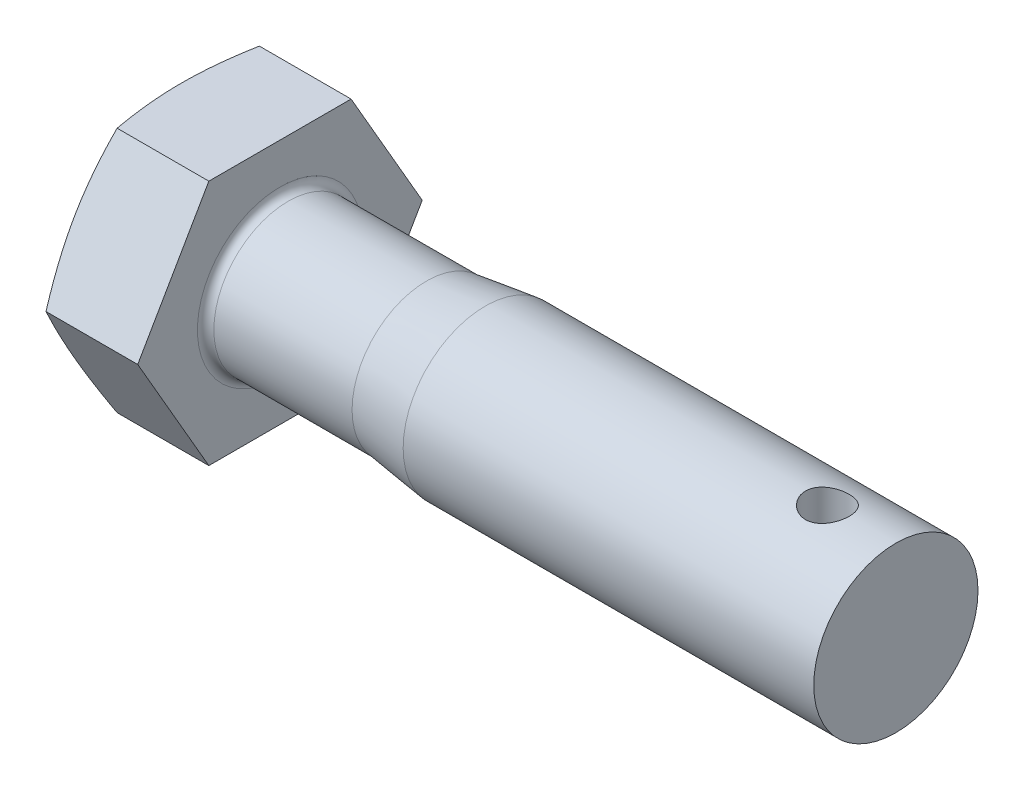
from build123d import *

# Parameters (mm, degrees)
BASEHEAD_DEPTH     = 7.5
SKETCH2_R          = 6
BASEBODY_DEPTH     = 45
SKETCH4_R          = 6.85
CUT_EXTRUDE1_DEPTH = 1.5
HEADFILLET_R       = 0.6
HOLE_DEPTH         = 55.270157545
HOLE_DEPTH_BACK    = 55.270157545
SKETCH6_R          = 1.6


with BuildPart() as part:
    # Sketch1 → BaseHead (new body)
    with BuildSketch(Plane(origin=(0, 0, 0), x_dir=(0, 0, -1), z_dir=(1, 0, 0))):
        Polygon((5.196152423, -9), (10.392304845, 0), (5.196152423, 9), (-5.196152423, 9), (-10.392304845, 0), (-5.196152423, -9), align=None)
    extrude(amount=BASEHEAD_DEPTH)

    # Sketch2 → BaseBody (add)
    with BuildSketch(Plane(origin=(7.5, 0, 0), x_dir=(0, 0, -1), z_dir=(1, 0, 0))):
        with Locations(Location((0, 0, 0), (0, 0, 180))):
            Circle(SKETCH2_R)
    extrude(amount=BASEBODY_DEPTH)

    # Sketch3 → HeadChamfer (revolve, cut)
    with BuildSketch(Plane(origin=(3.161211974, 0, 2.612290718), x_dir=(0, 0, -1), z_dir=(0, 1, 0)), mode=Mode.PRIVATE) as headchamfer_sk:
        Polygon((13.004595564, 3.161211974), (13.004595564, 2.363278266), (10.812290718, 3.161211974), align=None)
    revolve(headchamfer_sk.sketch.rotate(Axis((1.089857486, 0, 0), (1, 0, 0)), 180), axis=Axis((1.089857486, 0, 0), (1, 0, 0)), mode=Mode.SUBTRACT)

    # Sketch4 → Cut-Extrude1 (cut)
    with BuildSketch(Plane(origin=(0, 0, 0), x_dir=(0, 0, -1), z_dir=(1, 0, 0))):
        Circle(SKETCH4_R)
    extrude(amount=CUT_EXTRUDE1_DEPTH, mode=Mode.SUBTRACT)

    # Sketch5 → Cut-Revolve1 (revolve, cut)
    with BuildSketch(Plane(origin=(-2.92963122, 0, 7.92963122), x_dir=(0, 0, -1), z_dir=(0, 1, 0)), mode=Mode.PRIVATE) as cut_revolve1_sk:
        Polygon((13.92963122, -25.42963122), (13.36113122, -21.12963122), (13.36113122, -10.42963122), (18.79263122, -10.42963122), (18.79263122, -25.42963122), align=None)
    revolve(cut_revolve1_sk.sketch.rotate(Axis((0, 0, 0), (1, 0, 0)), 180), axis=Axis((0, 0, 0), (1, 0, 0)), mode=Mode.SUBTRACT)

    # HeadFillet
    headfillet_edges = [part.edges().sort_by_distance(p)[0] for p in [
        (7.5, 0, -5.4315),
    ]]
    fillet(headfillet_edges, radius=HEADFILLET_R)

    # Sketch6 → Hole (cut, two sides: drawn at the far end of the back side and taken through both)
    with BuildSketch(Plane(origin=(0, 0, 0), x_dir=(1, 0, 0), z_dir=(0, 1, 0)).offset(-HOLE_DEPTH_BACK)):
        with Locations(Location((47.5, 0, 0), (0, 0, 270))):
            Circle(SKETCH6_R)
    extrude(amount=HOLE_DEPTH + HOLE_DEPTH_BACK, mode=Mode.SUBTRACT)


solid = part.part
